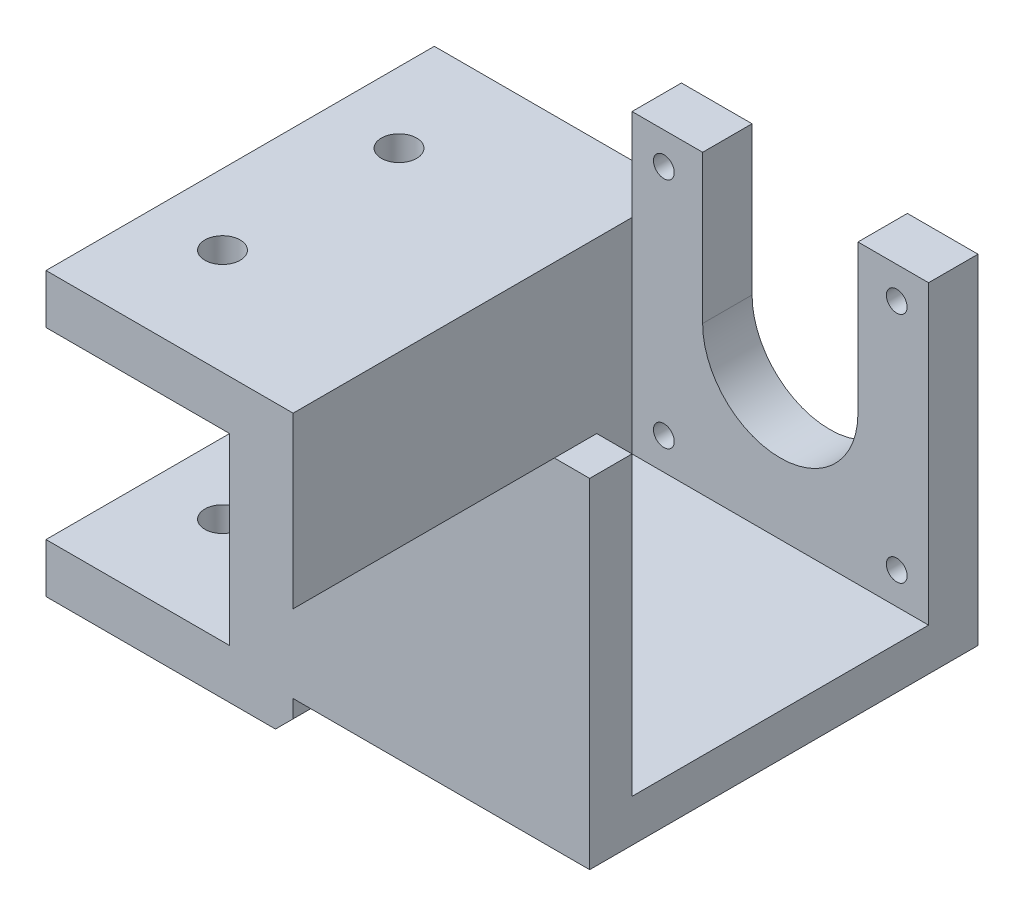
ISO-10303-21;
HEADER;
FILE_DESCRIPTION(('STEP AP214'),'2;1');
FILE_NAME('part.step','',(''),(''),'','','');
FILE_SCHEMA(('AUTOMOTIVE_DESIGN { 1 0 10303 214 1 1 1 1 }'));
ENDSEC;
DATA;
#1=APPLICATION_CONTEXT('core data for automotive mechanical design processes');
#2=APPLICATION_PROTOCOL_DEFINITION('international standard','automotive_design',2000,#1);
#3=PRODUCT_CONTEXT('',#1,'mechanical');
#4=PRODUCT('Part','Part','',(#3));
#5=PRODUCT_RELATED_PRODUCT_CATEGORY('part','',(#4));
#6=PRODUCT_DEFINITION_FORMATION('','',#4);
#7=PRODUCT_DEFINITION_CONTEXT('part definition',#1,'design');
#8=PRODUCT_DEFINITION('design','',#6,#7);
#9=PRODUCT_DEFINITION_SHAPE('','',#8);
#10=(LENGTH_UNIT() NAMED_UNIT(*) SI_UNIT(.MILLI.,.METRE.));
#11=(NAMED_UNIT(*) PLANE_ANGLE_UNIT() SI_UNIT($,.RADIAN.));
#12=(NAMED_UNIT(*) SI_UNIT($,.STERADIAN.) SOLID_ANGLE_UNIT());
#13=UNCERTAINTY_MEASURE_WITH_UNIT(LENGTH_MEASURE(1.E-05),#10,'distance_accuracy_value','');
#14=(GEOMETRIC_REPRESENTATION_CONTEXT(3) GLOBAL_UNCERTAINTY_ASSIGNED_CONTEXT((#13)) GLOBAL_UNIT_ASSIGNED_CONTEXT((#10,
#11,#12)) REPRESENTATION_CONTEXT('',''));
#15=CARTESIAN_POINT('',(0.,0.,0.));
#16=DIRECTION('',(0.,0.,1.));
#17=DIRECTION('',(1.,0.,0.));
#18=AXIS2_PLACEMENT_3D('',#15,#16,#17);
#19=CARTESIAN_POINT('',(-21.,-21.,55.));
#20=DIRECTION('',(1.,0.,0.));
#21=DIRECTION('',(0.,1.,0.));
#22=AXIS2_PLACEMENT_3D('',#19,#20,#21);
#23=PLANE('',#22);
#24=DIRECTION('',(0.,0.,-1.));
#25=VECTOR('',#24,1.);
#26=CARTESIAN_POINT('',(-21.,8.,55.));
#27=LINE('',#26,#25);
#28=CARTESIAN_POINT('',(-21.,7.99999999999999,7.));
#29=VERTEX_POINT('',#28);
#30=CARTESIAN_POINT('',(-21.,8.,0.));
#31=VERTEX_POINT('',#30);
#32=EDGE_CURVE('E11',#29,#31,#27,.T.);
#33=ORIENTED_EDGE('',*,*,#32,.F.);
#34=DIRECTION('',(0.,1.,0.));
#35=VECTOR('',#34,1.);
#36=CARTESIAN_POINT('',(-21.,-21.,7.));
#37=LINE('',#36,#35);
#38=CARTESIAN_POINT('',(-21.,21.,7.));
#39=VERTEX_POINT('',#38);
#40=EDGE_CURVE('E342',#29,#39,#37,.T.);
#41=ORIENTED_EDGE('',*,*,#40,.T.);
#42=DIRECTION('',(0.,0.,-1.));
#43=VECTOR('',#42,1.);
#44=CARTESIAN_POINT('',(-21.,21.,55.));
#45=LINE('',#44,#43);
#46=CARTESIAN_POINT('',(-21.,21.,0.));
#47=VERTEX_POINT('',#46);
#48=EDGE_CURVE('E428',#39,#47,#45,.T.);
#49=ORIENTED_EDGE('',*,*,#48,.T.);
#50=DIRECTION('',(0.,-1.,0.));
#51=VECTOR('',#50,1.);
#52=CARTESIAN_POINT('',(-21.,-21.,0.));
#53=LINE('',#52,#51);
#54=EDGE_CURVE('E417',#47,#31,#53,.T.);
#55=ORIENTED_EDGE('',*,*,#54,.T.);
#56=EDGE_LOOP('',(#33,#41,#49,#55));
#57=FACE_BOUND('',#56,.T.);
#58=ADVANCED_FACE('F44',(#57),#23,.F.);
#59=CARTESIAN_POINT('',(0.,-21.,0.));
#60=DIRECTION('',(0.,1.,0.));
#61=DIRECTION('',(0.,0.,1.));
#62=AXIS2_PLACEMENT_3D('',#59,#60,#61);
#63=PLANE('',#62);
#64=DIRECTION('',(0.,0.,1.));
#65=VECTOR('',#64,1.);
#66=CARTESIAN_POINT('',(-21.,-21.,7.));
#67=LINE('',#66,#65);
#68=CARTESIAN_POINT('',(-21.,-21.,7.));
#69=VERTEX_POINT('',#68);
#70=CARTESIAN_POINT('',(-21.,-21.,49.));
#71=VERTEX_POINT('',#70);
#72=EDGE_CURVE('E330',#69,#71,#67,.T.);
#73=ORIENTED_EDGE('',*,*,#72,.T.);
#74=DIRECTION('',(1.,0.,0.));
#75=VECTOR('',#74,1.);
#76=CARTESIAN_POINT('',(-21.,-21.,49.));
#77=LINE('',#76,#75);
#78=CARTESIAN_POINT('',(21.,-21.,49.));
#79=VERTEX_POINT('',#78);
#80=EDGE_CURVE('E289',#71,#79,#77,.T.);
#81=ORIENTED_EDGE('',*,*,#80,.T.);
#82=DIRECTION('',(0.,0.,-1.));
#83=VECTOR('',#82,1.);
#84=CARTESIAN_POINT('',(21.,-21.,7.));
#85=LINE('',#84,#83);
#86=CARTESIAN_POINT('',(21.,-21.,7.));
#87=VERTEX_POINT('',#86);
#88=EDGE_CURVE('E323',#79,#87,#85,.T.);
#89=ORIENTED_EDGE('',*,*,#88,.T.);
#90=DIRECTION('',(-1.,0.,0.));
#91=VECTOR('',#90,1.);
#92=CARTESIAN_POINT('',(-21.,-21.,7.));
#93=LINE('',#92,#91);
#94=EDGE_CURVE('E326',#87,#69,#93,.T.);
#95=ORIENTED_EDGE('',*,*,#94,.T.);
#96=EDGE_LOOP('',(#73,#81,#89,#95));
#97=FACE_BOUND('',#96,.T.);
#98=ADVANCED_FACE('F593',(#97),#63,.T.);
#99=CARTESIAN_POINT('',(0.,0.,55.));
#100=DIRECTION('',(0.,0.,1.));
#101=DIRECTION('',(1.,0.,0.));
#102=AXIS2_PLACEMENT_3D('',#99,#100,#101);
#103=PLANE('',#102);
#104=DIRECTION('',(0.707106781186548,0.707106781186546,0.));
#105=VECTOR('',#104,1.);
#106=CARTESIAN_POINT('',(-21.,-29.5,55.));
#107=LINE('',#106,#105);
#108=CARTESIAN_POINT('',(-23.5,-32.,55.));
#109=VERTEX_POINT('',#108);
#110=CARTESIAN_POINT('',(-21.,-29.5,55.));
#111=VERTEX_POINT('',#110);
#112=EDGE_CURVE('E198',#109,#111,#107,.T.);
#113=ORIENTED_EDGE('',*,*,#112,.T.);
#114=DIRECTION('',(0.,1.,0.));
#115=VECTOR('',#114,1.);
#116=CARTESIAN_POINT('',(-21.,0.,55.));
#117=LINE('',#116,#115);
#118=CARTESIAN_POINT('',(-21.,-27.,55.));
#119=VERTEX_POINT('',#118);
#120=EDGE_CURVE('E209',#111,#119,#117,.T.);
#121=ORIENTED_EDGE('',*,*,#120,.T.);
#122=DIRECTION('',(1.,0.,0.));
#123=VECTOR('',#122,1.);
#124=CARTESIAN_POINT('',(-21.,-27.,55.));
#125=LINE('',#124,#123);
#126=CARTESIAN_POINT('',(21.,-27.,55.));
#127=VERTEX_POINT('',#126);
#128=EDGE_CURVE('E389',#119,#127,#125,.T.);
#129=ORIENTED_EDGE('',*,*,#128,.T.);
#130=DIRECTION('',(0.,1.,0.));
#131=VECTOR('',#130,1.);
#132=CARTESIAN_POINT('',(21.,-21.,55.));
#133=LINE('',#132,#131);
#134=CARTESIAN_POINT('',(21.,21.,55.));
#135=VERTEX_POINT('',#134);
#136=EDGE_CURVE('E386',#127,#135,#133,.T.);
#137=ORIENTED_EDGE('',*,*,#136,.T.);
#138=DIRECTION('',(-1.,0.,0.));
#139=VECTOR('',#138,1.);
#140=CARTESIAN_POINT('',(21.,21.,55.));
#141=LINE('',#140,#139);
#142=CARTESIAN_POINT('',(16.,21.,55.));
#143=VERTEX_POINT('',#142);
#144=EDGE_CURVE('E266',#135,#143,#141,.T.);
#145=ORIENTED_EDGE('',*,*,#144,.T.);
#146=DIRECTION('',(-0.707106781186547,-0.707106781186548,0.));
#147=VECTOR('',#146,1.);
#148=CARTESIAN_POINT('',(16.,21.,55.));
#149=LINE('',#148,#147);
#150=CARTESIAN_POINT('',(-21.,-16.,55.));
#151=VERTEX_POINT('',#150);
#152=EDGE_CURVE('E290',#143,#151,#149,.T.);
#153=ORIENTED_EDGE('',*,*,#152,.T.);
#154=CARTESIAN_POINT('',(-21.,8.,55.));
#155=VERTEX_POINT('',#154);
#156=EDGE_CURVE('E220',#151,#155,#117,.T.);
#157=ORIENTED_EDGE('',*,*,#156,.T.);
#158=DIRECTION('',(-1.,0.,0.));
#159=VECTOR('',#158,1.);
#160=CARTESIAN_POINT('',(0.,8.,55.));
#161=LINE('',#160,#159);
#162=CARTESIAN_POINT('',(-56.,8.,55.));
#163=VERTEX_POINT('',#162);
#164=EDGE_CURVE('E226',#155,#163,#161,.T.);
#165=ORIENTED_EDGE('',*,*,#164,.T.);
#166=DIRECTION('',(0.,1.,0.));
#167=VECTOR('',#166,1.);
#168=CARTESIAN_POINT('',(-56.,0.,55.));
#169=LINE('',#168,#167);
#170=CARTESIAN_POINT('',(-56.,0.999999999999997,55.));
#171=VERTEX_POINT('',#170);
#172=EDGE_CURVE('E483',#171,#163,#169,.T.);
#173=ORIENTED_EDGE('',*,*,#172,.F.);
#174=DIRECTION('',(1.,0.,0.));
#175=VECTOR('',#174,1.);
#176=CARTESIAN_POINT('',(0.,0.999999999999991,55.));
#177=LINE('',#176,#175);
#178=CARTESIAN_POINT('',(-30.,0.999999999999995,55.));
#179=VERTEX_POINT('',#178);
#180=EDGE_CURVE('E481',#171,#179,#177,.T.);
#181=ORIENTED_EDGE('',*,*,#180,.T.);
#182=DIRECTION('',(0.,-1.,0.));
#183=VECTOR('',#182,1.);
#184=CARTESIAN_POINT('',(-30.,0.,55.));
#185=LINE('',#184,#183);
#186=CARTESIAN_POINT('',(-30.,-25.,55.));
#187=VERTEX_POINT('',#186);
#188=EDGE_CURVE('E262',#179,#187,#185,.T.);
#189=ORIENTED_EDGE('',*,*,#188,.T.);
#190=DIRECTION('',(1.,0.,0.));
#191=VECTOR('',#190,1.);
#192=CARTESIAN_POINT('',(0.,-25.,55.));
#193=LINE('',#192,#191);
#194=CARTESIAN_POINT('',(-56.,-25.,55.));
#195=VERTEX_POINT('',#194);
#196=EDGE_CURVE('E230',#195,#187,#193,.T.);
#197=ORIENTED_EDGE('',*,*,#196,.F.);
#198=CARTESIAN_POINT('',(-56.,-32.,55.));
#199=VERTEX_POINT('',#198);
#200=EDGE_CURVE('E224',#199,#195,#169,.T.);
#201=ORIENTED_EDGE('',*,*,#200,.F.);
#202=DIRECTION('',(-1.,0.,0.));
#203=VECTOR('',#202,1.);
#204=CARTESIAN_POINT('',(0.,-32.,55.));
#205=LINE('',#204,#203);
#206=EDGE_CURVE('E212',#109,#199,#205,.T.);
#207=ORIENTED_EDGE('',*,*,#206,.F.);
#208=EDGE_LOOP('',(#113,#121,#129,#137,#145,#153,#157,#165,#173,#181,#189,#197,#201,#207));
#209=FACE_BOUND('',#208,.T.);
#210=ADVANCED_FACE('F208',(#209),#103,.T.);
#211=CARTESIAN_POINT('',(0.,0.,0.));
#212=DIRECTION('',(0.,0.,1.));
#213=DIRECTION('',(1.,0.,0.));
#214=AXIS2_PLACEMENT_3D('',#211,#212,#213);
#215=PLANE('',#214);
#216=DIRECTION('',(0.,1.,0.));
#217=VECTOR('',#216,1.);
#218=CARTESIAN_POINT('',(-21.,0.,0.));
#219=LINE('',#218,#217);
#220=CARTESIAN_POINT('',(-21.,-29.5,0.));
#221=VERTEX_POINT('',#220);
#222=CARTESIAN_POINT('',(-21.,-27.,0.));
#223=VERTEX_POINT('',#222);
#224=EDGE_CURVE('E252',#221,#223,#219,.T.);
#225=ORIENTED_EDGE('',*,*,#224,.F.);
#226=DIRECTION('',(0.707106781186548,0.707106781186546,0.));
#227=VECTOR('',#226,1.);
#228=CARTESIAN_POINT('',(-21.,-29.5,0.));
#229=LINE('',#228,#227);
#230=CARTESIAN_POINT('',(-23.5,-32.,0.));
#231=VERTEX_POINT('',#230);
#232=EDGE_CURVE('E63',#231,#221,#229,.T.);
#233=ORIENTED_EDGE('',*,*,#232,.F.);
#234=DIRECTION('',(-1.,0.,0.));
#235=VECTOR('',#234,1.);
#236=CARTESIAN_POINT('',(0.,-32.,0.));
#237=LINE('',#236,#235);
#238=CARTESIAN_POINT('',(-56.,-32.,0.));
#239=VERTEX_POINT('',#238);
#240=EDGE_CURVE('E255',#231,#239,#237,.T.);
#241=ORIENTED_EDGE('',*,*,#240,.T.);
#242=DIRECTION('',(0.,1.,0.));
#243=VECTOR('',#242,1.);
#244=CARTESIAN_POINT('',(-56.,0.,0.));
#245=LINE('',#244,#243);
#246=CARTESIAN_POINT('',(-56.,-25.,0.));
#247=VERTEX_POINT('',#246);
#248=EDGE_CURVE('E248',#239,#247,#245,.T.);
#249=ORIENTED_EDGE('',*,*,#248,.T.);
#250=DIRECTION('',(1.,0.,0.));
#251=VECTOR('',#250,1.);
#252=CARTESIAN_POINT('',(0.,-25.,0.));
#253=LINE('',#252,#251);
#254=CARTESIAN_POINT('',(-30.,-25.,0.));
#255=VERTEX_POINT('',#254);
#256=EDGE_CURVE('E258',#247,#255,#253,.T.);
#257=ORIENTED_EDGE('',*,*,#256,.T.);
#258=DIRECTION('',(0.,-1.,0.));
#259=VECTOR('',#258,1.);
#260=CARTESIAN_POINT('',(-30.,0.,0.));
#261=LINE('',#260,#259);
#262=CARTESIAN_POINT('',(-30.,0.999999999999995,0.));
#263=VERTEX_POINT('',#262);
#264=EDGE_CURVE('E235',#263,#255,#261,.T.);
#265=ORIENTED_EDGE('',*,*,#264,.F.);
#266=DIRECTION('',(1.,0.,0.));
#267=VECTOR('',#266,1.);
#268=CARTESIAN_POINT('',(0.,0.999999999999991,0.));
#269=LINE('',#268,#267);
#270=CARTESIAN_POINT('',(-56.,0.999999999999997,0.));
#271=VERTEX_POINT('',#270);
#272=EDGE_CURVE('E239',#271,#263,#269,.T.);
#273=ORIENTED_EDGE('',*,*,#272,.F.);
#274=CARTESIAN_POINT('',(-56.,8.,0.));
#275=VERTEX_POINT('',#274);
#276=EDGE_CURVE('E243',#271,#275,#245,.T.);
#277=ORIENTED_EDGE('',*,*,#276,.T.);
#278=DIRECTION('',(-1.,0.,0.));
#279=VECTOR('',#278,1.);
#280=CARTESIAN_POINT('',(0.,8.,0.));
#281=LINE('',#280,#279);
#282=EDGE_CURVE('E247',#31,#275,#281,.T.);
#283=ORIENTED_EDGE('',*,*,#282,.F.);
#284=ORIENTED_EDGE('',*,*,#54,.F.);
#285=DIRECTION('',(-1.,0.,0.));
#286=VECTOR('',#285,1.);
#287=CARTESIAN_POINT('',(-21.,21.,0.));
#288=LINE('',#287,#286);
#289=CARTESIAN_POINT('',(-11.,21.,0.));
#290=VERTEX_POINT('',#289);
#291=EDGE_CURVE('E413',#290,#47,#288,.T.);
#292=ORIENTED_EDGE('',*,*,#291,.F.);
#293=DIRECTION('',(0.,1.,0.));
#294=VECTOR('',#293,1.);
#295=CARTESIAN_POINT('',(-11.,0.,0.));
#296=LINE('',#295,#294);
#297=CARTESIAN_POINT('',(-11.,0.,0.));
#298=VERTEX_POINT('',#297);
#299=EDGE_CURVE('E409',#298,#290,#296,.T.);
#300=ORIENTED_EDGE('',*,*,#299,.F.);
#301=CARTESIAN_POINT('',(0.,0.,0.));
#302=DIRECTION('',(0.,0.,-1.));
#303=DIRECTION('',(1.,0.,0.));
#304=AXIS2_PLACEMENT_3D('',#301,#302,#303);
#305=CIRCLE('',#304,11.);
#306=CARTESIAN_POINT('',(11.,0.,0.));
#307=VERTEX_POINT('',#306);
#308=EDGE_CURVE('E405',#307,#298,#305,.T.);
#309=ORIENTED_EDGE('',*,*,#308,.F.);
#310=DIRECTION('',(0.,-1.,0.));
#311=VECTOR('',#310,1.);
#312=CARTESIAN_POINT('',(11.,0.,0.));
#313=LINE('',#312,#311);
#314=CARTESIAN_POINT('',(11.,21.,0.));
#315=VERTEX_POINT('',#314);
#316=EDGE_CURVE('E401',#315,#307,#313,.T.);
#317=ORIENTED_EDGE('',*,*,#316,.F.);
#318=DIRECTION('',(-1.,0.,0.));
#319=VECTOR('',#318,1.);
#320=CARTESIAN_POINT('',(11.,21.,0.));
#321=LINE('',#320,#319);
#322=CARTESIAN_POINT('',(21.,21.,0.));
#323=VERTEX_POINT('',#322);
#324=EDGE_CURVE('E397',#323,#315,#321,.T.);
#325=ORIENTED_EDGE('',*,*,#324,.F.);
#326=DIRECTION('',(0.,1.,0.));
#327=VECTOR('',#326,1.);
#328=CARTESIAN_POINT('',(21.,21.,0.));
#329=LINE('',#328,#327);
#330=CARTESIAN_POINT('',(21.,-27.,0.));
#331=VERTEX_POINT('',#330);
#332=EDGE_CURVE('E385',#331,#323,#329,.T.);
#333=ORIENTED_EDGE('',*,*,#332,.F.);
#334=DIRECTION('',(1.,0.,0.));
#335=VECTOR('',#334,1.);
#336=CARTESIAN_POINT('',(-21.,-27.,0.));
#337=LINE('',#336,#335);
#338=EDGE_CURVE('E390',#223,#331,#337,.T.);
#339=ORIENTED_EDGE('',*,*,#338,.F.);
#340=EDGE_LOOP('',(#225,#233,#241,#249,#257,#265,#273,#277,#283,#284,#292,#300,#309,#317,#325,
#333,#339));
#341=FACE_BOUND('',#340,.T.);
#342=CARTESIAN_POINT('',(-16.49,16.49,0.));
#343=DIRECTION('',(0.,0.,1.));
#344=DIRECTION('',(1.,0.,0.));
#345=AXIS2_PLACEMENT_3D('',#342,#343,#344);
#346=CIRCLE('',#345,1.47);
#347=CARTESIAN_POINT('',(-15.02,16.49,0.));
#348=VERTEX_POINT('',#347);
#349=EDGE_CURVE('E381',#348,#348,#346,.T.);
#350=ORIENTED_EDGE('',*,*,#349,.T.);
#351=EDGE_LOOP('',(#350));
#352=FACE_BOUND('',#351,.T.);
#353=CARTESIAN_POINT('',(16.49,-16.49,0.));
#354=DIRECTION('',(0.,0.,1.));
#355=DIRECTION('',(-1.,0.,0.));
#356=AXIS2_PLACEMENT_3D('',#353,#354,#355);
#357=CIRCLE('',#356,1.47);
#358=CARTESIAN_POINT('',(15.02,-16.49,0.));
#359=VERTEX_POINT('',#358);
#360=EDGE_CURVE('E377',#359,#359,#357,.T.);
#361=ORIENTED_EDGE('',*,*,#360,.T.);
#362=EDGE_LOOP('',(#361));
#363=FACE_BOUND('',#362,.T.);
#364=CARTESIAN_POINT('',(16.49,16.49,0.));
#365=DIRECTION('',(0.,0.,1.));
#366=DIRECTION('',(1.,0.,0.));
#367=AXIS2_PLACEMENT_3D('',#364,#365,#366);
#368=CIRCLE('',#367,1.47);
#369=CARTESIAN_POINT('',(17.96,16.49,0.));
#370=VERTEX_POINT('',#369);
#371=EDGE_CURVE('E373',#370,#370,#368,.T.);
#372=ORIENTED_EDGE('',*,*,#371,.T.);
#373=EDGE_LOOP('',(#372));
#374=FACE_BOUND('',#373,.T.);
#375=CARTESIAN_POINT('',(-16.49,-16.49,0.));
#376=DIRECTION('',(0.,0.,1.));
#377=DIRECTION('',(-1.,0.,0.));
#378=AXIS2_PLACEMENT_3D('',#375,#376,#377);
#379=CIRCLE('',#378,1.46999999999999);
#380=CARTESIAN_POINT('',(-17.96,-16.49,0.));
#381=VERTEX_POINT('',#380);
#382=EDGE_CURVE('E369',#381,#381,#379,.T.);
#383=ORIENTED_EDGE('',*,*,#382,.T.);
#384=EDGE_LOOP('',(#383));
#385=FACE_BOUND('',#384,.T.);
#386=ADVANCED_FACE('F504',(#341,#352,#363,#374,#385),#215,.F.);
#387=CARTESIAN_POINT('',(21.,21.,55.));
#388=DIRECTION('',(-1.,0.,0.));
#389=DIRECTION('',(0.,-1.,0.));
#390=AXIS2_PLACEMENT_3D('',#387,#388,#389);
#391=PLANE('',#390);
#392=ORIENTED_EDGE('',*,*,#88,.F.);
#393=DIRECTION('',(0.,1.,0.));
#394=VECTOR('',#393,1.);
#395=CARTESIAN_POINT('',(21.,-21.,49.));
#396=LINE('',#395,#394);
#397=CARTESIAN_POINT('',(21.,21.,49.));
#398=VERTEX_POINT('',#397);
#399=EDGE_CURVE('E294',#79,#398,#396,.T.);
#400=ORIENTED_EDGE('',*,*,#399,.T.);
#401=DIRECTION('',(0.,0.,1.));
#402=VECTOR('',#401,1.);
#403=CARTESIAN_POINT('',(21.,21.,49.));
#404=LINE('',#403,#402);
#405=EDGE_CURVE('E306',#398,#135,#404,.T.);
#406=ORIENTED_EDGE('',*,*,#405,.T.);
#407=ORIENTED_EDGE('',*,*,#136,.F.);
#408=DIRECTION('',(0.,0.,-1.));
#409=VECTOR('',#408,1.);
#410=CARTESIAN_POINT('',(21.,-27.,55.));
#411=LINE('',#410,#409);
#412=EDGE_CURVE('E393',#127,#331,#411,.T.);
#413=ORIENTED_EDGE('',*,*,#412,.T.);
#414=ORIENTED_EDGE('',*,*,#332,.T.);
#415=DIRECTION('',(0.,0.,-1.));
#416=VECTOR('',#415,1.);
#417=CARTESIAN_POINT('',(21.,21.,55.));
#418=LINE('',#417,#416);
#419=CARTESIAN_POINT('',(21.,21.,7.));
#420=VERTEX_POINT('',#419);
#421=EDGE_CURVE('E54',#420,#323,#418,.T.);
#422=ORIENTED_EDGE('',*,*,#421,.F.);
#423=DIRECTION('',(0.,1.,0.));
#424=VECTOR('',#423,1.);
#425=CARTESIAN_POINT('',(21.,-21.,7.));
#426=LINE('',#425,#424);
#427=EDGE_CURVE('E334',#87,#420,#426,.T.);
#428=ORIENTED_EDGE('',*,*,#427,.F.);
#429=EDGE_LOOP('',(#392,#400,#406,#407,#413,#414,#422,#428));
#430=FACE_BOUND('',#429,.T.);
#431=ADVANCED_FACE('F46',(#430),#391,.F.);
#432=CARTESIAN_POINT('',(11.,21.,55.));
#433=DIRECTION('',(0.,-1.,0.));
#434=DIRECTION('',(0.,0.,-1.));
#435=AXIS2_PLACEMENT_3D('',#432,#433,#434);
#436=PLANE('',#435);
#437=DIRECTION('',(0.,0.,-1.));
#438=VECTOR('',#437,1.);
#439=CARTESIAN_POINT('',(11.,21.,55.));
#440=LINE('',#439,#438);
#441=CARTESIAN_POINT('',(11.,21.,7.));
#442=VERTEX_POINT('',#441);
#443=EDGE_CURVE('E440',#442,#315,#440,.T.);
#444=ORIENTED_EDGE('',*,*,#443,.F.);
#445=DIRECTION('',(-1.,0.,0.));
#446=VECTOR('',#445,1.);
#447=CARTESIAN_POINT('',(-21.,21.,7.));
#448=LINE('',#447,#446);
#449=EDGE_CURVE('E327',#420,#442,#448,.T.);
#450=ORIENTED_EDGE('',*,*,#449,.F.);
#451=ORIENTED_EDGE('',*,*,#421,.T.);
#452=ORIENTED_EDGE('',*,*,#324,.T.);
#453=EDGE_LOOP('',(#444,#450,#451,#452));
#454=FACE_BOUND('',#453,.T.);
#455=ADVANCED_FACE('F574',(#454),#436,.F.);
#456=CARTESIAN_POINT('',(11.,0.,55.));
#457=DIRECTION('',(1.,0.,0.));
#458=DIRECTION('',(0.,0.,-1.));
#459=AXIS2_PLACEMENT_3D('',#456,#457,#458);
#460=PLANE('',#459);
#461=DIRECTION('',(0.,0.,-1.));
#462=VECTOR('',#461,1.);
#463=CARTESIAN_POINT('',(11.,0.,55.));
#464=LINE('',#463,#462);
#465=CARTESIAN_POINT('',(11.,0.,7.));
#466=VERTEX_POINT('',#465);
#467=EDGE_CURVE('E437',#466,#307,#464,.T.);
#468=ORIENTED_EDGE('',*,*,#467,.F.);
#469=DIRECTION('',(0.,1.,0.));
#470=VECTOR('',#469,1.);
#471=CARTESIAN_POINT('',(11.,0.,7.));
#472=LINE('',#471,#470);
#473=EDGE_CURVE('E365',#466,#442,#472,.T.);
#474=ORIENTED_EDGE('',*,*,#473,.T.);
#475=ORIENTED_EDGE('',*,*,#443,.T.);
#476=ORIENTED_EDGE('',*,*,#316,.T.);
#477=EDGE_LOOP('',(#468,#474,#475,#476));
#478=FACE_BOUND('',#477,.T.);
#479=ADVANCED_FACE('F570',(#478),#460,.F.);
#480=CARTESIAN_POINT('',(0.,0.,55.));
#481=DIRECTION('',(0.,0.,-1.));
#482=DIRECTION('',(-1.,0.,0.));
#483=AXIS2_PLACEMENT_3D('',#480,#481,#482);
#484=CYLINDRICAL_SURFACE('',#483,11.);
#485=DIRECTION('',(0.,0.,-1.));
#486=VECTOR('',#485,1.);
#487=CARTESIAN_POINT('',(-11.,0.,55.));
#488=LINE('',#487,#486);
#489=CARTESIAN_POINT('',(-11.,0.,7.));
#490=VERTEX_POINT('',#489);
#491=EDGE_CURVE('E434',#490,#298,#488,.T.);
#492=ORIENTED_EDGE('',*,*,#491,.F.);
#493=CARTESIAN_POINT('',(0.,0.,7.));
#494=DIRECTION('',(0.,0.,-1.));
#495=DIRECTION('',(-1.,0.,0.));
#496=AXIS2_PLACEMENT_3D('',#493,#494,#495);
#497=CIRCLE('',#496,11.);
#498=EDGE_CURVE('E361',#490,#466,#497,.F.);
#499=ORIENTED_EDGE('',*,*,#498,.T.);
#500=ORIENTED_EDGE('',*,*,#467,.T.);
#501=ORIENTED_EDGE('',*,*,#308,.T.);
#502=EDGE_LOOP('',(#492,#499,#500,#501));
#503=FACE_BOUND('',#502,.T.);
#504=ADVANCED_FACE('F567',(#503),#484,.F.);
#505=CARTESIAN_POINT('',(-11.,0.,55.));
#506=DIRECTION('',(-1.,0.,0.));
#507=DIRECTION('',(0.,0.,1.));
#508=AXIS2_PLACEMENT_3D('',#505,#506,#507);
#509=PLANE('',#508);
#510=DIRECTION('',(0.,0.,-1.));
#511=VECTOR('',#510,1.);
#512=CARTESIAN_POINT('',(-11.,21.,55.));
#513=LINE('',#512,#511);
#514=CARTESIAN_POINT('',(-11.,21.,7.));
#515=VERTEX_POINT('',#514);
#516=EDGE_CURVE('E431',#515,#290,#513,.T.);
#517=ORIENTED_EDGE('',*,*,#516,.F.);
#518=DIRECTION('',(0.,-1.,0.));
#519=VECTOR('',#518,1.);
#520=CARTESIAN_POINT('',(-11.,0.,7.));
#521=LINE('',#520,#519);
#522=EDGE_CURVE('E357',#515,#490,#521,.T.);
#523=ORIENTED_EDGE('',*,*,#522,.T.);
#524=ORIENTED_EDGE('',*,*,#491,.T.);
#525=ORIENTED_EDGE('',*,*,#299,.T.);
#526=EDGE_LOOP('',(#517,#523,#524,#525));
#527=FACE_BOUND('',#526,.T.);
#528=ADVANCED_FACE('F561',(#527),#509,.F.);
#529=CARTESIAN_POINT('',(-21.,21.,55.));
#530=DIRECTION('',(0.,-1.,0.));
#531=DIRECTION('',(0.,0.,-1.));
#532=AXIS2_PLACEMENT_3D('',#529,#530,#531);
#533=PLANE('',#532);
#534=ORIENTED_EDGE('',*,*,#48,.F.);
#535=EDGE_CURVE('E316',#515,#39,#448,.T.);
#536=ORIENTED_EDGE('',*,*,#535,.F.);
#537=ORIENTED_EDGE('',*,*,#516,.T.);
#538=ORIENTED_EDGE('',*,*,#291,.T.);
#539=EDGE_LOOP('',(#534,#536,#537,#538));
#540=FACE_BOUND('',#539,.T.);
#541=ADVANCED_FACE('F558',(#540),#533,.F.);
#542=CARTESIAN_POINT('',(-21.,-27.,55.));
#543=DIRECTION('',(0.,1.,0.));
#544=DIRECTION('',(0.,0.,1.));
#545=AXIS2_PLACEMENT_3D('',#542,#543,#544);
#546=PLANE('',#545);
#547=ORIENTED_EDGE('',*,*,#338,.T.);
#548=ORIENTED_EDGE('',*,*,#412,.F.);
#549=ORIENTED_EDGE('',*,*,#128,.F.);
#550=DIRECTION('',(0.,0.,-1.));
#551=VECTOR('',#550,1.);
#552=CARTESIAN_POINT('',(-21.,-27.,55.));
#553=LINE('',#552,#551);
#554=EDGE_CURVE('E218',#119,#223,#553,.T.);
#555=ORIENTED_EDGE('',*,*,#554,.T.);
#556=EDGE_LOOP('',(#547,#548,#549,#555));
#557=FACE_BOUND('',#556,.T.);
#558=ADVANCED_FACE('F580',(#557),#546,.F.);
#559=CARTESIAN_POINT('',(-16.49,16.49,55.));
#560=DIRECTION('',(0.,0.,-1.));
#561=DIRECTION('',(-1.,0.,0.));
#562=AXIS2_PLACEMENT_3D('',#559,#560,#561);
#563=CYLINDRICAL_SURFACE('',#562,1.47);
#564=CARTESIAN_POINT('',(-16.49,16.49,7.));
#565=DIRECTION('',(0.,0.,-1.));
#566=DIRECTION('',(-1.,0.,0.));
#567=AXIS2_PLACEMENT_3D('',#564,#565,#566);
#568=CIRCLE('',#567,1.47);
#569=CARTESIAN_POINT('',(-17.96,16.49,7.));
#570=VERTEX_POINT('',#569);
#571=EDGE_CURVE('E353',#570,#570,#568,.T.);
#572=ORIENTED_EDGE('',*,*,#571,.F.);
#573=EDGE_LOOP('',(#572));
#574=FACE_BOUND('',#573,.T.);
#575=ORIENTED_EDGE('',*,*,#349,.F.);
#576=EDGE_LOOP('',(#575));
#577=FACE_BOUND('',#576,.T.);
#578=ADVANCED_FACE('F620',(#574,#577),#563,.F.);
#579=CARTESIAN_POINT('',(16.49,-16.49,55.));
#580=DIRECTION('',(0.,0.,-1.));
#581=DIRECTION('',(-1.,0.,0.));
#582=AXIS2_PLACEMENT_3D('',#579,#580,#581);
#583=CYLINDRICAL_SURFACE('',#582,1.47);
#584=CARTESIAN_POINT('',(16.49,-16.49,7.));
#585=DIRECTION('',(0.,0.,-1.));
#586=DIRECTION('',(-1.,0.,0.));
#587=AXIS2_PLACEMENT_3D('',#584,#585,#586);
#588=CIRCLE('',#587,1.47);
#589=CARTESIAN_POINT('',(15.02,-16.49,7.));
#590=VERTEX_POINT('',#589);
#591=EDGE_CURVE('E349',#590,#590,#588,.T.);
#592=ORIENTED_EDGE('',*,*,#591,.F.);
#593=EDGE_LOOP('',(#592));
#594=FACE_BOUND('',#593,.T.);
#595=ORIENTED_EDGE('',*,*,#360,.F.);
#596=EDGE_LOOP('',(#595));
#597=FACE_BOUND('',#596,.T.);
#598=ADVANCED_FACE('F616',(#594,#597),#583,.F.);
#599=CARTESIAN_POINT('',(16.49,16.49,55.));
#600=DIRECTION('',(0.,0.,-1.));
#601=DIRECTION('',(-1.,0.,0.));
#602=AXIS2_PLACEMENT_3D('',#599,#600,#601);
#603=CYLINDRICAL_SURFACE('',#602,1.47);
#604=CARTESIAN_POINT('',(16.49,16.49,7.));
#605=DIRECTION('',(0.,0.,-1.));
#606=DIRECTION('',(-1.,0.,0.));
#607=AXIS2_PLACEMENT_3D('',#604,#605,#606);
#608=CIRCLE('',#607,1.47);
#609=CARTESIAN_POINT('',(15.02,16.49,7.));
#610=VERTEX_POINT('',#609);
#611=EDGE_CURVE('E345',#610,#610,#608,.T.);
#612=ORIENTED_EDGE('',*,*,#611,.F.);
#613=EDGE_LOOP('',(#612));
#614=FACE_BOUND('',#613,.T.);
#615=ORIENTED_EDGE('',*,*,#371,.F.);
#616=EDGE_LOOP('',(#615));
#617=FACE_BOUND('',#616,.T.);
#618=ADVANCED_FACE('F612',(#614,#617),#603,.F.);
#619=CARTESIAN_POINT('',(-16.49,-16.49,55.));
#620=DIRECTION('',(0.,0.,-1.));
#621=DIRECTION('',(-1.,0.,0.));
#622=AXIS2_PLACEMENT_3D('',#619,#620,#621);
#623=CYLINDRICAL_SURFACE('',#622,1.46999999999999);
#624=CARTESIAN_POINT('',(-16.49,-16.49,7.));
#625=DIRECTION('',(0.,0.,-1.));
#626=DIRECTION('',(-1.,0.,0.));
#627=AXIS2_PLACEMENT_3D('',#624,#625,#626);
#628=CIRCLE('',#627,1.46999999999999);
#629=CARTESIAN_POINT('',(-17.96,-16.49,7.));
#630=VERTEX_POINT('',#629);
#631=EDGE_CURVE('E341',#630,#630,#628,.T.);
#632=ORIENTED_EDGE('',*,*,#631,.F.);
#633=EDGE_LOOP('',(#632));
#634=FACE_BOUND('',#633,.T.);
#635=ORIENTED_EDGE('',*,*,#382,.F.);
#636=EDGE_LOOP('',(#635));
#637=FACE_BOUND('',#636,.T.);
#638=ADVANCED_FACE('F608',(#634,#637),#623,.F.);
#639=CARTESIAN_POINT('',(-21.,-21.,7.));
#640=DIRECTION('',(0.,0.,-1.));
#641=DIRECTION('',(-1.,0.,0.));
#642=AXIS2_PLACEMENT_3D('',#639,#640,#641);
#643=PLANE('',#642);
#644=ORIENTED_EDGE('',*,*,#571,.T.);
#645=EDGE_LOOP('',(#644));
#646=FACE_BOUND('',#645,.T.);
#647=ORIENTED_EDGE('',*,*,#591,.T.);
#648=EDGE_LOOP('',(#647));
#649=FACE_BOUND('',#648,.T.);
#650=ORIENTED_EDGE('',*,*,#611,.T.);
#651=EDGE_LOOP('',(#650));
#652=FACE_BOUND('',#651,.T.);
#653=ORIENTED_EDGE('',*,*,#631,.T.);
#654=EDGE_LOOP('',(#653));
#655=FACE_BOUND('',#654,.T.);
#656=ORIENTED_EDGE('',*,*,#498,.F.);
#657=ORIENTED_EDGE('',*,*,#522,.F.);
#658=ORIENTED_EDGE('',*,*,#535,.T.);
#659=ORIENTED_EDGE('',*,*,#40,.F.);
#660=EDGE_CURVE('E337',#69,#29,#37,.T.);
#661=ORIENTED_EDGE('',*,*,#660,.F.);
#662=ORIENTED_EDGE('',*,*,#94,.F.);
#663=ORIENTED_EDGE('',*,*,#427,.T.);
#664=ORIENTED_EDGE('',*,*,#449,.T.);
#665=ORIENTED_EDGE('',*,*,#473,.F.);
#666=EDGE_LOOP('',(#656,#657,#658,#659,#661,#662,#663,#664,#665));
#667=FACE_BOUND('',#666,.T.);
#668=ADVANCED_FACE('F548',(#646,#649,#652,#655,#667),#643,.F.);
#669=CARTESIAN_POINT('',(16.,21.,49.));
#670=DIRECTION('',(-0.707106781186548,0.707106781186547,0.));
#671=DIRECTION('',(-0.707106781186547,-0.707106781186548,0.));
#672=AXIS2_PLACEMENT_3D('',#669,#670,#671);
#673=PLANE('',#672);
#674=ORIENTED_EDGE('',*,*,#152,.F.);
#675=DIRECTION('',(0.,0.,1.));
#676=VECTOR('',#675,1.);
#677=CARTESIAN_POINT('',(16.,21.,49.));
#678=LINE('',#677,#676);
#679=CARTESIAN_POINT('',(16.,21.,49.));
#680=VERTEX_POINT('',#679);
#681=EDGE_CURVE('E317',#680,#143,#678,.T.);
#682=ORIENTED_EDGE('',*,*,#681,.F.);
#683=DIRECTION('',(-0.707106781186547,-0.707106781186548,0.));
#684=VECTOR('',#683,1.);
#685=CARTESIAN_POINT('',(16.,21.,49.));
#686=LINE('',#685,#684);
#687=CARTESIAN_POINT('',(-21.,-16.,49.));
#688=VERTEX_POINT('',#687);
#689=EDGE_CURVE('E302',#680,#688,#686,.T.);
#690=ORIENTED_EDGE('',*,*,#689,.T.);
#691=DIRECTION('',(0.,0.,1.));
#692=VECTOR('',#691,1.);
#693=CARTESIAN_POINT('',(-21.,-16.,49.));
#694=LINE('',#693,#692);
#695=EDGE_CURVE('E313',#688,#151,#694,.T.);
#696=ORIENTED_EDGE('',*,*,#695,.T.);
#697=EDGE_LOOP('',(#674,#682,#690,#696));
#698=FACE_BOUND('',#697,.T.);
#699=ADVANCED_FACE('F587',(#698),#673,.T.);
#700=CARTESIAN_POINT('',(21.,21.,49.));
#701=DIRECTION('',(0.,1.,0.));
#702=DIRECTION('',(0.,0.,1.));
#703=AXIS2_PLACEMENT_3D('',#700,#701,#702);
#704=PLANE('',#703);
#705=ORIENTED_EDGE('',*,*,#144,.F.);
#706=ORIENTED_EDGE('',*,*,#405,.F.);
#707=DIRECTION('',(-1.,0.,0.));
#708=VECTOR('',#707,1.);
#709=CARTESIAN_POINT('',(21.,21.,49.));
#710=LINE('',#709,#708);
#711=EDGE_CURVE('E298',#398,#680,#710,.T.);
#712=ORIENTED_EDGE('',*,*,#711,.T.);
#713=ORIENTED_EDGE('',*,*,#681,.T.);
#714=EDGE_LOOP('',(#705,#706,#712,#713));
#715=FACE_BOUND('',#714,.T.);
#716=ADVANCED_FACE('F604',(#715),#704,.T.);
#717=CARTESIAN_POINT('',(0.,0.,49.));
#718=DIRECTION('',(0.,0.,1.));
#719=DIRECTION('',(1.,0.,0.));
#720=AXIS2_PLACEMENT_3D('',#717,#718,#719);
#721=PLANE('',#720);
#722=DIRECTION('',(0.,-1.,0.));
#723=VECTOR('',#722,1.);
#724=CARTESIAN_POINT('',(-21.,-16.,49.));
#725=LINE('',#724,#723);
#726=EDGE_CURVE('E285',#688,#71,#725,.T.);
#727=ORIENTED_EDGE('',*,*,#726,.F.);
#728=ORIENTED_EDGE('',*,*,#689,.F.);
#729=ORIENTED_EDGE('',*,*,#711,.F.);
#730=ORIENTED_EDGE('',*,*,#399,.F.);
#731=ORIENTED_EDGE('',*,*,#80,.F.);
#732=EDGE_LOOP('',(#727,#728,#729,#730,#731));
#733=FACE_BOUND('',#732,.T.);
#734=ADVANCED_FACE('F590',(#733),#721,.F.);
#735=CARTESIAN_POINT('',(-21.,0.,55.));
#736=DIRECTION('',(-1.,0.,0.));
#737=DIRECTION('',(0.,-1.,0.));
#738=AXIS2_PLACEMENT_3D('',#735,#736,#737);
#739=PLANE('',#738);
#740=ORIENTED_EDGE('',*,*,#695,.F.);
#741=ORIENTED_EDGE('',*,*,#726,.T.);
#742=ORIENTED_EDGE('',*,*,#72,.F.);
#743=ORIENTED_EDGE('',*,*,#660,.T.);
#744=EDGE_CURVE('E56',#155,#29,#27,.T.);
#745=ORIENTED_EDGE('',*,*,#744,.F.);
#746=ORIENTED_EDGE('',*,*,#156,.F.);
#747=EDGE_LOOP('',(#740,#741,#742,#743,#745,#746));
#748=FACE_BOUND('',#747,.T.);
#749=ADVANCED_FACE('F543',(#748),#739,.F.);
#750=CARTESIAN_POINT('',(-30.,0.,55.));
#751=DIRECTION('',(1.,0.,0.));
#752=DIRECTION('',(0.,1.,0.));
#753=AXIS2_PLACEMENT_3D('',#750,#751,#752);
#754=PLANE('',#753);
#755=ORIENTED_EDGE('',*,*,#264,.T.);
#756=DIRECTION('',(0.,0.,-1.));
#757=VECTOR('',#756,1.);
#758=CARTESIAN_POINT('',(-30.,-25.,55.));
#759=LINE('',#758,#757);
#760=EDGE_CURVE('E263',#187,#255,#759,.T.);
#761=ORIENTED_EDGE('',*,*,#760,.F.);
#762=ORIENTED_EDGE('',*,*,#188,.F.);
#763=DIRECTION('',(0.,0.,-1.));
#764=VECTOR('',#763,1.);
#765=CARTESIAN_POINT('',(-30.,0.999999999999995,55.));
#766=LINE('',#765,#764);
#767=EDGE_CURVE('E234',#179,#263,#766,.T.);
#768=ORIENTED_EDGE('',*,*,#767,.T.);
#769=EDGE_LOOP('',(#755,#761,#762,#768));
#770=FACE_BOUND('',#769,.T.);
#771=ADVANCED_FACE('F721',(#770),#754,.F.);
#772=CARTESIAN_POINT('',(0.,-25.,55.));
#773=DIRECTION('',(0.,1.,0.));
#774=DIRECTION('',(-1.,0.,0.));
#775=AXIS2_PLACEMENT_3D('',#772,#773,#774);
#776=PLANE('',#775);
#777=CARTESIAN_POINT('',(-46.,-25.,40.));
#778=DIRECTION('',(0.,1.,0.));
#779=DIRECTION('',(-1.,0.,0.));
#780=AXIS2_PLACEMENT_3D('',#777,#778,#779);
#781=CIRCLE('',#780,2.5);
#782=CARTESIAN_POINT('',(-48.5,-25.,40.));
#783=VERTEX_POINT('',#782);
#784=EDGE_CURVE('E240',#783,#783,#781,.T.);
#785=ORIENTED_EDGE('',*,*,#784,.F.);
#786=EDGE_LOOP('',(#785));
#787=FACE_BOUND('',#786,.T.);
#788=CARTESIAN_POINT('',(-46.,-25.,15.));
#789=DIRECTION('',(0.,1.,0.));
#790=DIRECTION('',(-1.,0.,0.));
#791=AXIS2_PLACEMENT_3D('',#788,#789,#790);
#792=CIRCLE('',#791,2.5);
#793=CARTESIAN_POINT('',(-48.5,-25.,15.));
#794=VERTEX_POINT('',#793);
#795=EDGE_CURVE('E457',#794,#794,#792,.T.);
#796=ORIENTED_EDGE('',*,*,#795,.F.);
#797=EDGE_LOOP('',(#796));
#798=FACE_BOUND('',#797,.T.);
#799=ORIENTED_EDGE('',*,*,#256,.F.);
#800=DIRECTION('',(0.,0.,-1.));
#801=VECTOR('',#800,1.);
#802=CARTESIAN_POINT('',(-56.,-25.,55.));
#803=LINE('',#802,#801);
#804=EDGE_CURVE('E267',#195,#247,#803,.T.);
#805=ORIENTED_EDGE('',*,*,#804,.F.);
#806=ORIENTED_EDGE('',*,*,#196,.T.);
#807=ORIENTED_EDGE('',*,*,#760,.T.);
#808=EDGE_LOOP('',(#799,#805,#806,#807));
#809=FACE_BOUND('',#808,.T.);
#810=ADVANCED_FACE('F501',(#787,#798,#809),#776,.T.);
#811=CARTESIAN_POINT('',(-56.,0.,55.));
#812=DIRECTION('',(-1.,0.,0.));
#813=DIRECTION('',(0.,0.,1.));
#814=AXIS2_PLACEMENT_3D('',#811,#812,#813);
#815=PLANE('',#814);
#816=ORIENTED_EDGE('',*,*,#248,.F.);
#817=DIRECTION('',(0.,0.,-1.));
#818=VECTOR('',#817,1.);
#819=CARTESIAN_POINT('',(-56.,-32.,55.));
#820=LINE('',#819,#818);
#821=EDGE_CURVE('E270',#199,#239,#820,.T.);
#822=ORIENTED_EDGE('',*,*,#821,.F.);
#823=ORIENTED_EDGE('',*,*,#200,.T.);
#824=ORIENTED_EDGE('',*,*,#804,.T.);
#825=EDGE_LOOP('',(#816,#822,#823,#824));
#826=FACE_BOUND('',#825,.T.);
#827=ADVANCED_FACE('F495',(#826),#815,.T.);
#828=CARTESIAN_POINT('',(0.,-32.,55.));
#829=DIRECTION('',(0.,-1.,0.));
#830=DIRECTION('',(0.,0.,-1.));
#831=AXIS2_PLACEMENT_3D('',#828,#829,#830);
#832=PLANE('',#831);
#833=DIRECTION('',(0.,0.,-1.));
#834=VECTOR('',#833,1.);
#835=CARTESIAN_POINT('',(-23.5,-32.,55.));
#836=LINE('',#835,#834);
#837=EDGE_CURVE('E204',#109,#231,#836,.T.);
#838=ORIENTED_EDGE('',*,*,#837,.F.);
#839=ORIENTED_EDGE('',*,*,#206,.T.);
#840=ORIENTED_EDGE('',*,*,#821,.T.);
#841=ORIENTED_EDGE('',*,*,#240,.F.);
#842=EDGE_LOOP('',(#838,#839,#840,#841));
#843=FACE_BOUND('',#842,.T.);
#844=CARTESIAN_POINT('',(-46.,-32.,40.));
#845=DIRECTION('',(0.,-1.,0.));
#846=DIRECTION('',(0.,0.,-1.));
#847=AXIS2_PLACEMENT_3D('',#844,#845,#846);
#848=CIRCLE('',#847,2.5);
#849=CARTESIAN_POINT('',(-46.,-32.,37.5));
#850=VERTEX_POINT('',#849);
#851=EDGE_CURVE('E451',#850,#850,#848,.T.);
#852=ORIENTED_EDGE('',*,*,#851,.F.);
#853=EDGE_LOOP('',(#852));
#854=FACE_BOUND('',#853,.T.);
#855=CARTESIAN_POINT('',(-46.,-32.,15.));
#856=DIRECTION('',(0.,-1.,0.));
#857=DIRECTION('',(0.,0.,-1.));
#858=AXIS2_PLACEMENT_3D('',#855,#856,#857);
#859=CIRCLE('',#858,2.5);
#860=CARTESIAN_POINT('',(-46.,-32.,12.5));
#861=VERTEX_POINT('',#860);
#862=EDGE_CURVE('E460',#861,#861,#859,.T.);
#863=ORIENTED_EDGE('',*,*,#862,.F.);
#864=EDGE_LOOP('',(#863));
#865=FACE_BOUND('',#864,.T.);
#866=ADVANCED_FACE('F741',(#843,#854,#865),#832,.T.);
#867=ORIENTED_EDGE('',*,*,#120,.F.);
#868=DIRECTION('',(0.,0.,-1.));
#869=VECTOR('',#868,1.);
#870=CARTESIAN_POINT('',(-21.,-29.5,55.));
#871=LINE('',#870,#869);
#872=EDGE_CURVE('E195',#111,#221,#871,.T.);
#873=ORIENTED_EDGE('',*,*,#872,.T.);
#874=ORIENTED_EDGE('',*,*,#224,.T.);
#875=ORIENTED_EDGE('',*,*,#554,.F.);
#876=EDGE_LOOP('',(#867,#873,#874,#875));
#877=FACE_BOUND('',#876,.T.);
#878=ADVANCED_FACE('F216',(#877),#739,.F.);
#879=CARTESIAN_POINT('',(0.,8.,55.));
#880=DIRECTION('',(0.,-1.,0.));
#881=DIRECTION('',(0.,0.,-1.));
#882=AXIS2_PLACEMENT_3D('',#879,#880,#881);
#883=PLANE('',#882);
#884=CARTESIAN_POINT('',(-46.,8.,40.));
#885=DIRECTION('',(0.,-1.,0.));
#886=DIRECTION('',(0.,0.,-1.));
#887=AXIS2_PLACEMENT_3D('',#884,#885,#886);
#888=CIRCLE('',#887,2.5);
#889=CARTESIAN_POINT('',(-46.,8.,37.5));
#890=VERTEX_POINT('',#889);
#891=EDGE_CURVE('E472',#890,#890,#888,.T.);
#892=ORIENTED_EDGE('',*,*,#891,.T.);
#893=EDGE_LOOP('',(#892));
#894=FACE_BOUND('',#893,.T.);
#895=CARTESIAN_POINT('',(-46.,8.,15.));
#896=DIRECTION('',(0.,-1.,0.));
#897=DIRECTION('',(0.,0.,-1.));
#898=AXIS2_PLACEMENT_3D('',#895,#896,#897);
#899=CIRCLE('',#898,2.5);
#900=CARTESIAN_POINT('',(-46.,8.,12.5));
#901=VERTEX_POINT('',#900);
#902=EDGE_CURVE('E450',#901,#901,#899,.T.);
#903=ORIENTED_EDGE('',*,*,#902,.T.);
#904=EDGE_LOOP('',(#903));
#905=FACE_BOUND('',#904,.T.);
#906=ORIENTED_EDGE('',*,*,#282,.T.);
#907=DIRECTION('',(0.,0.,-1.));
#908=VECTOR('',#907,1.);
#909=CARTESIAN_POINT('',(-56.,8.,55.));
#910=LINE('',#909,#908);
#911=EDGE_CURVE('E276',#163,#275,#910,.T.);
#912=ORIENTED_EDGE('',*,*,#911,.F.);
#913=ORIENTED_EDGE('',*,*,#164,.F.);
#914=ORIENTED_EDGE('',*,*,#744,.T.);
#915=ORIENTED_EDGE('',*,*,#32,.T.);
#916=EDGE_LOOP('',(#906,#912,#913,#914,#915));
#917=FACE_BOUND('',#916,.T.);
#918=ADVANCED_FACE('F524',(#894,#905,#917),#883,.F.);
#919=ORIENTED_EDGE('',*,*,#276,.F.);
#920=DIRECTION('',(0.,0.,-1.));
#921=VECTOR('',#920,1.);
#922=CARTESIAN_POINT('',(-56.,0.999999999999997,55.));
#923=LINE('',#922,#921);
#924=EDGE_CURVE('E279',#171,#271,#923,.T.);
#925=ORIENTED_EDGE('',*,*,#924,.F.);
#926=ORIENTED_EDGE('',*,*,#172,.T.);
#927=ORIENTED_EDGE('',*,*,#911,.T.);
#928=EDGE_LOOP('',(#919,#925,#926,#927));
#929=FACE_BOUND('',#928,.T.);
#930=ADVANCED_FACE('F527',(#929),#815,.T.);
#931=CARTESIAN_POINT('',(0.,0.999999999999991,55.));
#932=DIRECTION('',(0.,1.,0.));
#933=DIRECTION('',(-1.,0.,0.));
#934=AXIS2_PLACEMENT_3D('',#931,#932,#933);
#935=PLANE('',#934);
#936=CARTESIAN_POINT('',(-46.,0.999999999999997,40.));
#937=DIRECTION('',(0.,1.,0.));
#938=DIRECTION('',(-1.,0.,0.));
#939=AXIS2_PLACEMENT_3D('',#936,#937,#938);
#940=CIRCLE('',#939,2.5);
#941=CARTESIAN_POINT('',(-48.5,0.999999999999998,40.));
#942=VERTEX_POINT('',#941);
#943=EDGE_CURVE('E48',#942,#942,#940,.T.);
#944=ORIENTED_EDGE('',*,*,#943,.T.);
#945=EDGE_LOOP('',(#944));
#946=FACE_BOUND('',#945,.T.);
#947=CARTESIAN_POINT('',(-46.,0.999999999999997,15.));
#948=DIRECTION('',(0.,1.,0.));
#949=DIRECTION('',(-1.,0.,0.));
#950=AXIS2_PLACEMENT_3D('',#947,#948,#949);
#951=CIRCLE('',#950,2.5);
#952=CARTESIAN_POINT('',(-48.5,0.999999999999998,15.));
#953=VERTEX_POINT('',#952);
#954=EDGE_CURVE('E447',#953,#953,#951,.T.);
#955=ORIENTED_EDGE('',*,*,#954,.T.);
#956=EDGE_LOOP('',(#955));
#957=FACE_BOUND('',#956,.T.);
#958=ORIENTED_EDGE('',*,*,#272,.T.);
#959=ORIENTED_EDGE('',*,*,#767,.F.);
#960=ORIENTED_EDGE('',*,*,#180,.F.);
#961=ORIENTED_EDGE('',*,*,#924,.T.);
#962=EDGE_LOOP('',(#958,#959,#960,#961));
#963=FACE_BOUND('',#962,.T.);
#964=ADVANCED_FACE('F513',(#946,#957,#963),#935,.F.);
#965=CARTESIAN_POINT('',(-46.,23.,15.));
#966=DIRECTION('',(0.,-1.,0.));
#967=DIRECTION('',(0.,0.,-1.));
#968=AXIS2_PLACEMENT_3D('',#965,#966,#967);
#969=CYLINDRICAL_SURFACE('',#968,2.5);
#970=ORIENTED_EDGE('',*,*,#954,.F.);
#971=EDGE_LOOP('',(#970));
#972=FACE_BOUND('',#971,.T.);
#973=ORIENTED_EDGE('',*,*,#902,.F.);
#974=EDGE_LOOP('',(#973));
#975=FACE_BOUND('',#974,.T.);
#976=ADVANCED_FACE('F519',(#972,#975),#969,.F.);
#977=CARTESIAN_POINT('',(-46.,23.,40.));
#978=DIRECTION('',(0.,-1.,0.));
#979=DIRECTION('',(0.,0.,-1.));
#980=AXIS2_PLACEMENT_3D('',#977,#978,#979);
#981=CYLINDRICAL_SURFACE('',#980,2.5);
#982=ORIENTED_EDGE('',*,*,#943,.F.);
#983=EDGE_LOOP('',(#982));
#984=FACE_BOUND('',#983,.T.);
#985=ORIENTED_EDGE('',*,*,#891,.F.);
#986=EDGE_LOOP('',(#985));
#987=FACE_BOUND('',#986,.T.);
#988=ADVANCED_FACE('F515',(#984,#987),#981,.F.);
#989=ORIENTED_EDGE('',*,*,#795,.T.);
#990=EDGE_LOOP('',(#989));
#991=FACE_BOUND('',#990,.T.);
#992=ORIENTED_EDGE('',*,*,#862,.T.);
#993=EDGE_LOOP('',(#992));
#994=FACE_BOUND('',#993,.T.);
#995=ADVANCED_FACE('F518',(#991,#994),#969,.F.);
#996=ORIENTED_EDGE('',*,*,#784,.T.);
#997=EDGE_LOOP('',(#996));
#998=FACE_BOUND('',#997,.T.);
#999=ORIENTED_EDGE('',*,*,#851,.T.);
#1000=EDGE_LOOP('',(#999));
#1001=FACE_BOUND('',#1000,.T.);
#1002=ADVANCED_FACE('F521',(#998,#1001),#981,.F.);
#1003=CARTESIAN_POINT('',(-21.,-29.5,55.));
#1004=DIRECTION('',(-0.707106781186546,0.707106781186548,0.));
#1005=DIRECTION('',(-0.707106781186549,-0.707106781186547,0.));
#1006=AXIS2_PLACEMENT_3D('',#1003,#1004,#1005);
#1007=PLANE('',#1006);
#1008=ORIENTED_EDGE('',*,*,#232,.T.);
#1009=ORIENTED_EDGE('',*,*,#872,.F.);
#1010=ORIENTED_EDGE('',*,*,#112,.F.);
#1011=ORIENTED_EDGE('',*,*,#837,.T.);
#1012=EDGE_LOOP('',(#1008,#1009,#1010,#1011));
#1013=FACE_BOUND('',#1012,.T.);
#1014=ADVANCED_FACE('F197',(#1013),#1007,.F.);
#1015=CLOSED_SHELL('',(#58,#98,#210,#386,#431,#455,#479,#504,#528,#541,#558,#578,#598,#618,#638,
#668,#699,#716,#734,#749,#771,#810,#827,#866,#878,#918,#930,#964,#976,#988,#995,#1002,#1014));
#1016=MANIFOLD_SOLID_BREP('B2',#1015);
#1017=ADVANCED_BREP_SHAPE_REPRESENTATION('',(#18,#1016),#14);
#1018=SHAPE_DEFINITION_REPRESENTATION(#9,#1017);
ENDSEC;
END-ISO-10303-21;
